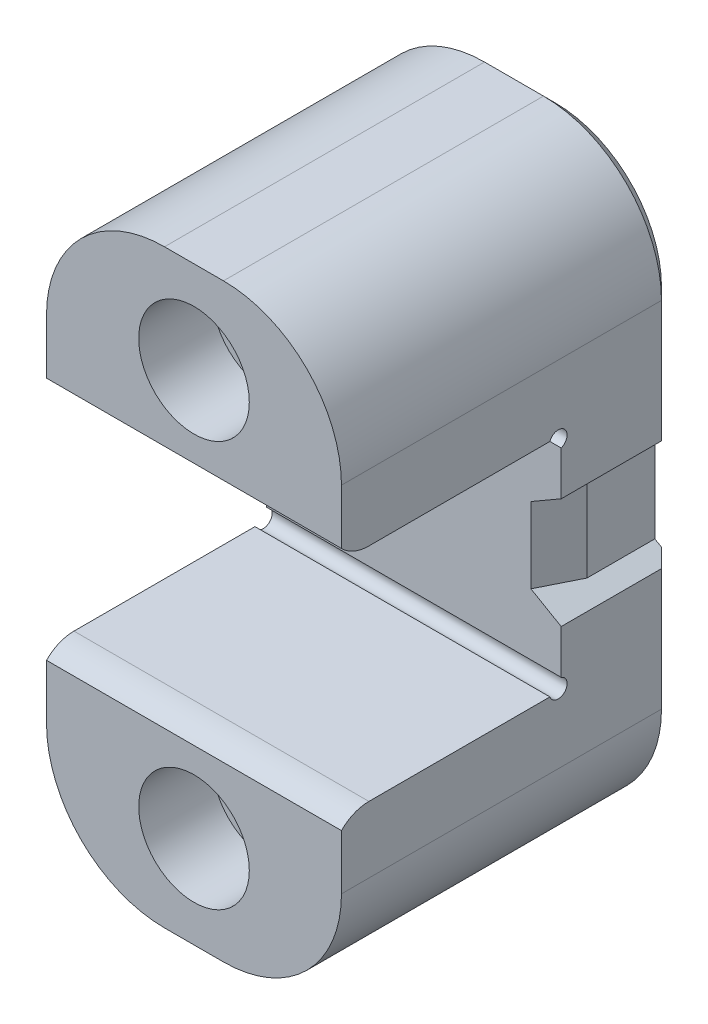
from build123d import *

# Parameters (mm, degrees)
EXTRUDE1_DEPTH          = 12.7
FILLET1_R               = 10.16
CUT_EXTRUDE1_DEPTH      = 48.730716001
CUT_EXTRUDE2_DEPTH      = 46.900442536
SKETCH6_R               = 0.762
CUT_EXTRUDE3_DEPTH      = 46.900442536
F_10_CBORE_D            = 4.572
F_10_CBORE_CBORE_D      = 9.525
F_10_CBORE_CBORE_DEPTH  = 6.35
F_1_4_20_TAPPED_HOLE1_D = 5.1054
CHAMFER3_SIZE           = 3.81
CHAMFER3_SIZE2          = 1.020886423
CHAMFER1_SIZE           = 1.016


with BuildPart() as part:
    # Sketch1 → Extrude1 (new, symmetric)
    with BuildSketch(Plane(origin=(0, 0, 0), x_dir=(0, 0, -1), z_dir=(1, 0, 0))):
        Polygon((0, 9.525), (18.923, 9.525), (18.923, -9.525), (0, -9.525), (0, -25.4), (28.575, -25.4), (28.575, 25.4), (0, 25.4), align=None)
    extrude(amount=EXTRUDE1_DEPTH, both=True)

    # Fillet1
    fillet1_edges = [part.edges().sort_by_distance(p)[0] for p in [
        (12.7, -25.4, -14.2875),
        (12.7, 25.4, -14.2875),
        (-12.7, 25.4, -14.2875),
        (-12.7, -25.4, -14.2875),
    ]]
    fillet(fillet1_edges, radius=FILLET1_R)

    # Sketch2 → Cut-Extrude1 (cut, through all)
    with BuildSketch(Plane(origin=(-15.875, 0, -28.575), x_dir=(1, 0, 0), z_dir=(0, 0, 1))):
        Polygon((26.9875, 3.845956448), (30.1625, 5.679043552), (30.1625, -5.679043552), (26.9875, -3.845956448), align=None)
    extrude(amount=CUT_EXTRUDE1_DEPTH, mode=Mode.SUBTRACT)

    # Sketch5 → Cut-Extrude2 (cut, through all)
    with BuildSketch(Plane(origin=(12.7, 0, 0), x_dir=(0, 0, -1), z_dir=(1, 0, 0))):
        with BuildLine():
            Line((-3.9878, -7.346019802), (2.3622, -7.346019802))
            Line((2.3622, -7.346019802), (2.3622, -9.525))
            ThreePointArc((2.3622, -9.525), (1.080400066, -9.78418595), (0, -10.521019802))
            Line((0, -10.521019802), (-3.9878, -10.521019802))
            Line((-3.9878, -10.521019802), (-3.9878, -7.346019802))
        make_face()
        with BuildLine():
            Line((2.3622, 7.346019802), (2.3622, 9.525))
            ThreePointArc((2.3622, 9.525), (1.080400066, 9.78418595), (0, 10.521019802))
            Line((0, 10.521019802), (-3.9878, 10.521019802))
            Line((-3.9878, 10.521019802), (-3.9878, 7.346019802))
            Line((-3.9878, 7.346019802), (2.3622, 7.346019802))
        make_face()
    extrude(amount=-CUT_EXTRUDE2_DEPTH, mode=Mode.SUBTRACT)

    # Sketch6 → Cut-Extrude3 (cut, through all)
    with BuildSketch(Plane(origin=(12.7, 0, 0), x_dir=(0, 0, -1), z_dir=(1, 0, 0))):
        with Locations((18.669, 9.271)):
            Circle(SKETCH6_R)
        with Locations((18.669, -9.271)):
            Circle(SKETCH6_R)
    extrude(amount=-CUT_EXTRUDE3_DEPTH, mode=Mode.SUBTRACT)

    # 10 CBORE (through all)
    with Locations(Plane.XY):
        with Locations((0, 17.4625), (0, -17.4625)):
            CounterBoreHole(F_10_CBORE_D / 2, F_10_CBORE_CBORE_D / 2, F_10_CBORE_CBORE_DEPTH)

    # 1_4-20 Tapped Hole1 (through all)
    with Locations(Plane.XY.offset(-6.35)):
        with Locations((0, -17.4625), (0, 17.4625)):
            Hole(F_1_4_20_TAPPED_HOLE1_D / 2)

    # Chamfer3
    chamfer3_edges = [part.edges().sort_by_distance(p)[0] for p in [
        (11.1125, 0, -18.923),
    ]]
    chamfer3_side = [part.faces().sort_by_distance(p)[0] for p in [
        (11.1125, 0, -23.749),
    ]]
    chamfer(chamfer3_edges, length=CHAMFER3_SIZE, length2=CHAMFER3_SIZE2, reference=chamfer3_side[0])

    # Chamfer1
    chamfer1_edges = [part.edges().sort_by_distance(p)[0] for p in [
        (12.7, -10.00125, -28.575),
        (-12.7, 0, -28.575),
        (0, 25.4, -28.575),
        (0, -25.4, -28.575),
        (-9.724204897, 22.424204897, -28.575),
        (-9.724204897, -22.424204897, -28.575),
        (9.724204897, 22.424204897, -28.575),
        (9.724204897, -22.424204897, -28.575),
        (12.7, 10.00125, -28.575),
    ]]
    chamfer(chamfer1_edges, length=CHAMFER1_SIZE)


solid = part.part
